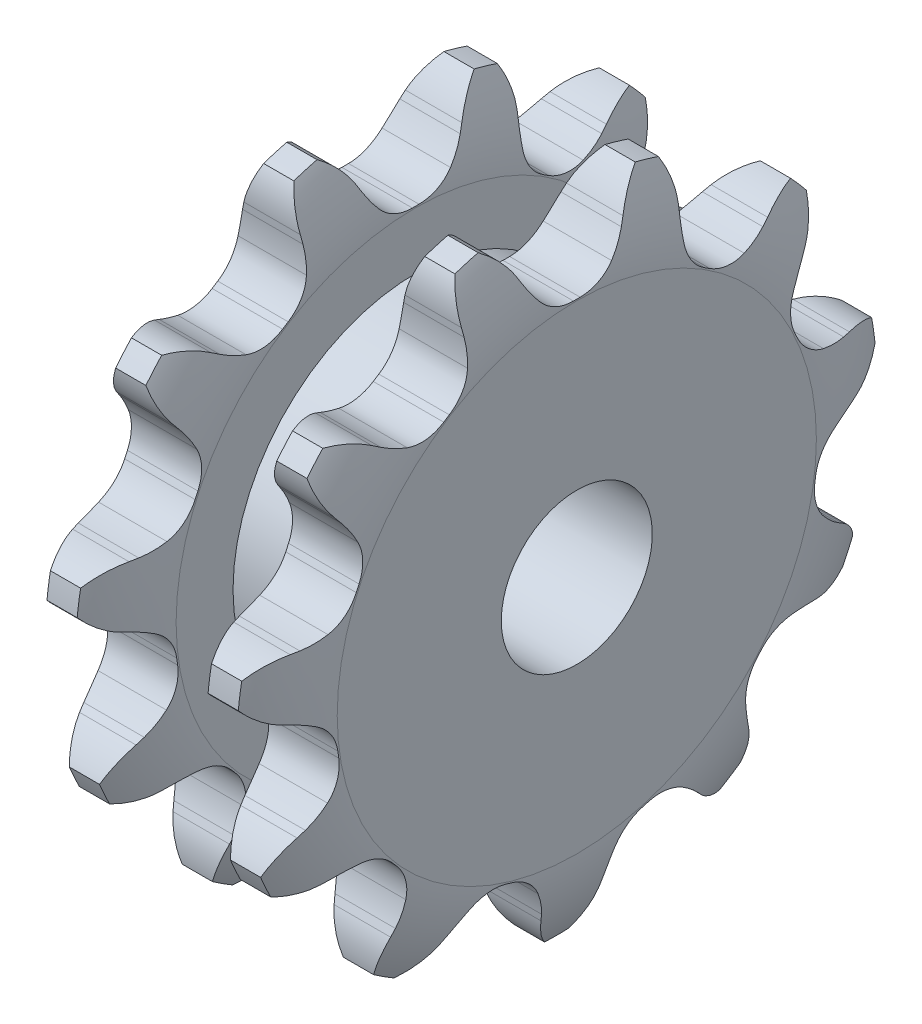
from build123d import *

# Parameters (mm, degrees)
TOOTHCUT_DEPTH  = 21.202424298
TEETHCUTS_COUNT = 11
TEETHCUTS_ANGLE = 327.272727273
BORSKE_R        = 3
BORE_DEPTH      = 95.0005


with BuildPart() as part:
    # BasProSke → Base-Revolve (revolve)
    with BuildSketch(Plane(origin=(0, 0, 0), x_dir=(1, 0, 0), z_dir=(0, 1, 0)), mode=Mode.PRIVATE) as base_revolve_sk:
        with BuildLine():
            Line((0, 0), (0, 9.518056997))
            ThreePointArc((0, 9.518056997), (0.203030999, 11.167299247), (0.8, 12.718056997))
            Line((0.8, 12.718056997), (8.4, 12.718056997))
            ThreePointArc((8.4, 12.718056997), (8.996969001, 11.167299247), (9.2, 9.518056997))
            Line((9.2, 9.518056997), (9.2, 0))
            Line((9.2, 0), (0, 0))
        make_face()
    revolve(base_revolve_sk.sketch.rotate(Axis((-10, 0, 0), (1, 0, 0)), 180), axis=Axis((-10, 0, 0), (1, 0, 0)))

    # GrvSke → Groove (revolve, cut)
    with BuildSketch(Plane(origin=(0, 0, 0), x_dir=(1, 0, 0), z_dir=(0, 1, 0)), mode=Mode.PRIVATE) as groove_sk:
        with BuildLine():
            Line((2.8, 9.518056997), (2.8, 7.257056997))
            Line((2.8, 7.257056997), (6.4, 7.257056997))
            Line((6.4, 7.257056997), (6.4, 9.518056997))
            ThreePointArc((6.4, 9.518056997), (6.603030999, 11.167299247), (7.2, 12.718056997))
            Line((7.2, 12.718056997), (2, 12.718056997))
            ThreePointArc((2, 12.718056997), (2.596969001, 11.167299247), (2.8, 9.518056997))
        make_face()
    revolve(groove_sk.sketch.rotate(Axis((0, 0, 0), (1, 0, 0)), 180), axis=Axis((0, 0, 0), (1, 0, 0)), mode=Mode.SUBTRACT)

    # TooCutSke → ToothCut (cut, through all)
    with BuildSketch(Plane(origin=(0, 0, 0), x_dir=(0, 0, -1), z_dir=(1, 0, 0))):
        with BuildLine():
            Line((1.969240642, 10.976206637), (2.110899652, 11.247804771))
            ThreePointArc((2.110899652, 11.247804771), (3.131182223, 12.335851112), (4.567724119, 12.73730939))
            ThreePointArc((4.567724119, 12.73730939), (0, 13.531561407), (-4.567724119, 12.73730939))
            ThreePointArc((-4.567724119, 12.73730939), (-3.131182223, 12.335851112), (-2.110899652, 11.247804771))
            Line((-2.110899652, 11.247804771), (-1.969240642, 10.976206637))
            ThreePointArc((-1.969240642, 10.976206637), (-1.719287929, 10.556452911), (-1.423732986, 10.167458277))
            ThreePointArc((-1.423732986, 10.167458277), (-0.84340558, 9.727618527), (-0.13218, 9.571422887))
            Line((-0.13218, 9.571422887), (0.13218, 9.571422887))
            ThreePointArc((0.13218, 9.571422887), (0.84340558, 9.727618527), (1.423732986, 10.167458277))
            ThreePointArc((1.423732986, 10.167458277), (1.719287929, 10.556452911), (1.969240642, 10.976206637))
        make_face()
    toothcut = extrude(amount=TOOTHCUT_DEPTH, mode=Mode.SUBTRACT)

    # TeethCuts: ToothCut ×11 about axis
    teethcuts_axis = Axis((-10, 0, 0), (1, 0, 0))
    for i in range(1, TEETHCUTS_COUNT):
        add(toothcut.rotate(teethcuts_axis, i * TEETHCUTS_ANGLE / (TEETHCUTS_COUNT - 1)), mode=Mode.SUBTRACT)

    # BorSke → Bore (cut, symmetric)
    with BuildSketch(Plane(origin=(0, 0, 0), x_dir=(0, 0, -1), z_dir=(1, 0, 0))):
        with Locations(Location((0, 0, 0), (0, 0, 180))):
            Circle(BORSKE_R)
    extrude(amount=BORE_DEPTH, both=True, mode=Mode.SUBTRACT)


solid = part.part
